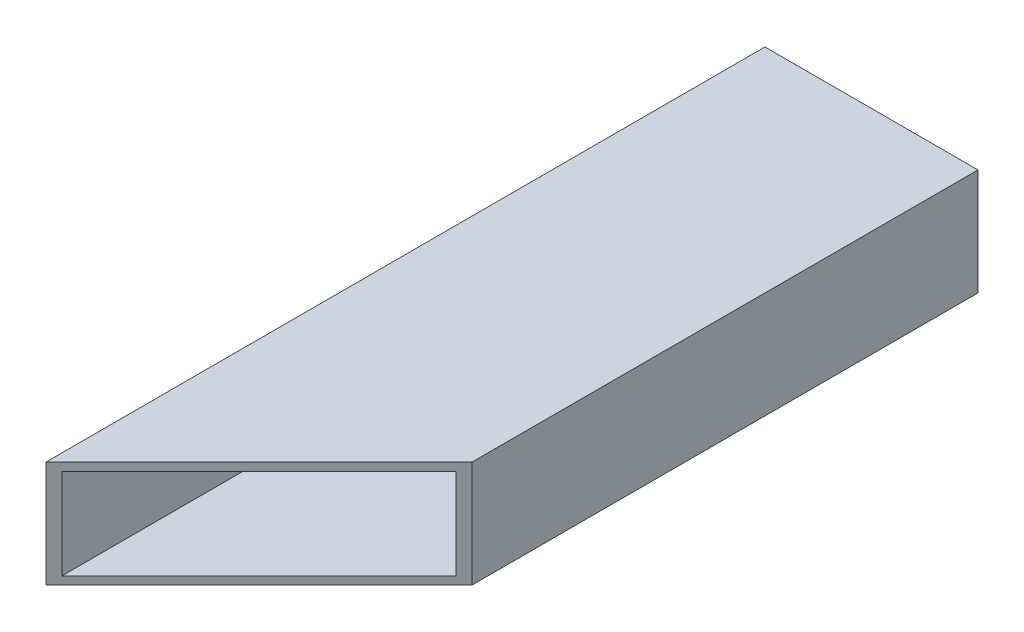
ISO-10303-21;
HEADER;
FILE_DESCRIPTION(('STEP AP214'),'2;1');
FILE_NAME('part.step','',(''),(''),'','','');
FILE_SCHEMA(('AUTOMOTIVE_DESIGN { 1 0 10303 214 1 1 1 1 }'));
ENDSEC;
DATA;
#1=APPLICATION_CONTEXT('core data for automotive mechanical design processes');
#2=APPLICATION_PROTOCOL_DEFINITION('international standard','automotive_design',2000,#1);
#3=PRODUCT_CONTEXT('',#1,'mechanical');
#4=PRODUCT('Part','Part','',(#3));
#5=PRODUCT_RELATED_PRODUCT_CATEGORY('part','',(#4));
#6=PRODUCT_DEFINITION_FORMATION('','',#4);
#7=PRODUCT_DEFINITION_CONTEXT('part definition',#1,'design');
#8=PRODUCT_DEFINITION('design','',#6,#7);
#9=PRODUCT_DEFINITION_SHAPE('','',#8);
#10=(LENGTH_UNIT() NAMED_UNIT(*) SI_UNIT(.MILLI.,.METRE.));
#11=(NAMED_UNIT(*) PLANE_ANGLE_UNIT() SI_UNIT($,.RADIAN.));
#12=(NAMED_UNIT(*) SI_UNIT($,.STERADIAN.) SOLID_ANGLE_UNIT());
#13=UNCERTAINTY_MEASURE_WITH_UNIT(LENGTH_MEASURE(1.E-05),#10,'distance_accuracy_value','');
#14=(GEOMETRIC_REPRESENTATION_CONTEXT(3) GLOBAL_UNCERTAINTY_ASSIGNED_CONTEXT((#13)) GLOBAL_UNIT_ASSIGNED_CONTEXT((#10,
#11,#12)) REPRESENTATION_CONTEXT('',''));
#15=CARTESIAN_POINT('',(0.,0.,0.));
#16=DIRECTION('',(0.,0.,1.));
#17=DIRECTION('',(1.,0.,0.));
#18=AXIS2_PLACEMENT_3D('',#15,#16,#17);
#19=CARTESIAN_POINT('',(0.,40.,0.));
#20=DIRECTION('',(0.,0.,-1.));
#21=DIRECTION('',(-1.,0.,0.));
#22=AXIS2_PLACEMENT_3D('',#19,#20,#21);
#23=PLANE('',#22);
#24=DIRECTION('',(0.,-1.,0.));
#25=VECTOR('',#24,1.);
#26=CARTESIAN_POINT('',(0.,0.,0.));
#27=LINE('',#26,#25);
#28=CARTESIAN_POINT('',(0.,40.,0.));
#29=VERTEX_POINT('',#28);
#30=CARTESIAN_POINT('',(0.,0.,0.));
#31=VERTEX_POINT('',#30);
#32=EDGE_CURVE('E118',#29,#31,#27,.T.);
#33=ORIENTED_EDGE('',*,*,#32,.F.);
#34=DIRECTION('',(-1.,0.,0.));
#35=VECTOR('',#34,1.);
#36=CARTESIAN_POINT('',(0.,40.,0.));
#37=LINE('',#36,#35);
#38=CARTESIAN_POINT('',(80.,40.,0.));
#39=VERTEX_POINT('',#38);
#40=EDGE_CURVE('E138',#39,#29,#37,.T.);
#41=ORIENTED_EDGE('',*,*,#40,.F.);
#42=DIRECTION('',(0.,1.,0.));
#43=VECTOR('',#42,1.);
#44=CARTESIAN_POINT('',(80.,0.,0.));
#45=LINE('',#44,#43);
#46=CARTESIAN_POINT('',(80.,0.,0.));
#47=VERTEX_POINT('',#46);
#48=EDGE_CURVE('E135',#47,#39,#45,.T.);
#49=ORIENTED_EDGE('',*,*,#48,.F.);
#50=DIRECTION('',(1.,0.,0.));
#51=VECTOR('',#50,1.);
#52=CARTESIAN_POINT('',(0.,0.,0.));
#53=LINE('',#52,#51);
#54=EDGE_CURVE('E132',#31,#47,#53,.T.);
#55=ORIENTED_EDGE('',*,*,#54,.F.);
#56=EDGE_LOOP('',(#33,#41,#49,#55));
#57=FACE_BOUND('',#56,.T.);
#58=DIRECTION('',(-1.,0.,0.));
#59=VECTOR('',#58,1.);
#60=CARTESIAN_POINT('',(2.99999999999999,37.,0.));
#61=LINE('',#60,#59);
#62=CARTESIAN_POINT('',(77.,37.,0.));
#63=VERTEX_POINT('',#62);
#64=CARTESIAN_POINT('',(2.99999999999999,37.,0.));
#65=VERTEX_POINT('',#64);
#66=EDGE_CURVE('E121',#63,#65,#61,.T.);
#67=ORIENTED_EDGE('',*,*,#66,.T.);
#68=DIRECTION('',(0.,-1.,0.));
#69=VECTOR('',#68,1.);
#70=CARTESIAN_POINT('',(2.99999999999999,37.,0.));
#71=LINE('',#70,#69);
#72=CARTESIAN_POINT('',(3.,3.,0.));
#73=VERTEX_POINT('',#72);
#74=EDGE_CURVE('E77',#65,#73,#71,.T.);
#75=ORIENTED_EDGE('',*,*,#74,.T.);
#76=DIRECTION('',(1.,0.,0.));
#77=VECTOR('',#76,1.);
#78=CARTESIAN_POINT('',(3.,3.,0.));
#79=LINE('',#78,#77);
#80=CARTESIAN_POINT('',(77.,3.,0.));
#81=VERTEX_POINT('',#80);
#82=EDGE_CURVE('E104',#73,#81,#79,.T.);
#83=ORIENTED_EDGE('',*,*,#82,.T.);
#84=DIRECTION('',(0.,1.,0.));
#85=VECTOR('',#84,1.);
#86=CARTESIAN_POINT('',(77.,37.,0.));
#87=LINE('',#86,#85);
#88=EDGE_CURVE('E113',#81,#63,#87,.T.);
#89=ORIENTED_EDGE('',*,*,#88,.T.);
#90=EDGE_LOOP('',(#67,#75,#83,#89));
#91=FACE_BOUND('',#90,.T.);
#92=ADVANCED_FACE('F32',(#57,#91),#23,.T.);
#93=CARTESIAN_POINT('',(0.,0.,270.));
#94=DIRECTION('',(1.,0.,0.));
#95=DIRECTION('',(0.,1.,0.));
#96=AXIS2_PLACEMENT_3D('',#93,#94,#95);
#97=PLANE('',#96);
#98=ORIENTED_EDGE('',*,*,#32,.T.);
#99=DIRECTION('',(0.,0.,-1.));
#100=VECTOR('',#99,1.);
#101=CARTESIAN_POINT('',(0.,0.,270.));
#102=LINE('',#101,#100);
#103=CARTESIAN_POINT('',(0.,0.,270.));
#104=VERTEX_POINT('',#103);
#105=EDGE_CURVE('E150',#104,#31,#102,.T.);
#106=ORIENTED_EDGE('',*,*,#105,.F.);
#107=DIRECTION('',(0.,-1.,0.));
#108=VECTOR('',#107,1.);
#109=CARTESIAN_POINT('',(0.,0.,270.));
#110=LINE('',#109,#108);
#111=CARTESIAN_POINT('',(0.,40.,270.));
#112=VERTEX_POINT('',#111);
#113=EDGE_CURVE('E140',#112,#104,#110,.T.);
#114=ORIENTED_EDGE('',*,*,#113,.F.);
#115=DIRECTION('',(0.,0.,-1.));
#116=VECTOR('',#115,1.);
#117=CARTESIAN_POINT('',(0.,40.,270.));
#118=LINE('',#117,#116);
#119=EDGE_CURVE('E143',#112,#29,#118,.T.);
#120=ORIENTED_EDGE('',*,*,#119,.T.);
#121=EDGE_LOOP('',(#98,#106,#114,#120));
#122=FACE_BOUND('',#121,.T.);
#123=ADVANCED_FACE('F174',(#122),#97,.F.);
#124=CARTESIAN_POINT('',(0.,0.,270.));
#125=DIRECTION('',(0.,1.,0.));
#126=DIRECTION('',(0.,0.,1.));
#127=AXIS2_PLACEMENT_3D('',#124,#125,#126);
#128=PLANE('',#127);
#129=DIRECTION('',(0.,0.,-1.));
#130=VECTOR('',#129,1.);
#131=CARTESIAN_POINT('',(80.,0.,270.));
#132=LINE('',#131,#130);
#133=CARTESIAN_POINT('',(80.,0.,190.));
#134=VERTEX_POINT('',#133);
#135=EDGE_CURVE('E148',#134,#47,#132,.T.);
#136=ORIENTED_EDGE('',*,*,#135,.F.);
#137=DIRECTION('',(0.707106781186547,0.,-0.707106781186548));
#138=VECTOR('',#137,1.);
#139=CARTESIAN_POINT('',(-2.4980018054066E-13,0.,270.));
#140=LINE('',#139,#138);
#141=EDGE_CURVE('E11',#134,#104,#140,.F.);
#142=ORIENTED_EDGE('',*,*,#141,.T.);
#143=ORIENTED_EDGE('',*,*,#105,.T.);
#144=ORIENTED_EDGE('',*,*,#54,.T.);
#145=EDGE_LOOP('',(#136,#142,#143,#144));
#146=FACE_BOUND('',#145,.T.);
#147=ADVANCED_FACE('F180',(#146),#128,.F.);
#148=CARTESIAN_POINT('',(80.,0.,270.));
#149=DIRECTION('',(-1.,0.,0.));
#150=DIRECTION('',(0.,0.,1.));
#151=AXIS2_PLACEMENT_3D('',#148,#149,#150);
#152=PLANE('',#151);
#153=DIRECTION('',(0.,0.,-1.));
#154=VECTOR('',#153,1.);
#155=CARTESIAN_POINT('',(80.,40.,270.));
#156=LINE('',#155,#154);
#157=CARTESIAN_POINT('',(80.,40.,190.));
#158=VERTEX_POINT('',#157);
#159=EDGE_CURVE('E146',#158,#39,#156,.T.);
#160=ORIENTED_EDGE('',*,*,#159,.F.);
#161=DIRECTION('',(0.,-1.,0.));
#162=VECTOR('',#161,1.);
#163=CARTESIAN_POINT('',(80.,0.,190.));
#164=LINE('',#163,#162);
#165=EDGE_CURVE('E42',#158,#134,#164,.T.);
#166=ORIENTED_EDGE('',*,*,#165,.T.);
#167=ORIENTED_EDGE('',*,*,#135,.T.);
#168=ORIENTED_EDGE('',*,*,#48,.T.);
#169=EDGE_LOOP('',(#160,#166,#167,#168));
#170=FACE_BOUND('',#169,.T.);
#171=ADVANCED_FACE('F188',(#170),#152,.F.);
#172=CARTESIAN_POINT('',(0.,40.,270.));
#173=DIRECTION('',(0.,-1.,0.));
#174=DIRECTION('',(0.,0.,-1.));
#175=AXIS2_PLACEMENT_3D('',#172,#173,#174);
#176=PLANE('',#175);
#177=ORIENTED_EDGE('',*,*,#119,.F.);
#178=DIRECTION('',(-0.707106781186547,0.,0.707106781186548));
#179=VECTOR('',#178,1.);
#180=CARTESIAN_POINT('',(-2.4980018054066E-13,40.,270.));
#181=LINE('',#180,#179);
#182=EDGE_CURVE('E153',#112,#158,#181,.F.);
#183=ORIENTED_EDGE('',*,*,#182,.T.);
#184=ORIENTED_EDGE('',*,*,#159,.T.);
#185=ORIENTED_EDGE('',*,*,#40,.T.);
#186=EDGE_LOOP('',(#177,#183,#184,#185));
#187=FACE_BOUND('',#186,.T.);
#188=ADVANCED_FACE('F185',(#187),#176,.F.);
#189=CARTESIAN_POINT('',(2.99999999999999,37.,270.));
#190=DIRECTION('',(1.,0.,0.));
#191=DIRECTION('',(0.,1.,0.));
#192=AXIS2_PLACEMENT_3D('',#189,#190,#191);
#193=PLANE('',#192);
#194=ORIENTED_EDGE('',*,*,#74,.F.);
#195=DIRECTION('',(0.,0.,-1.));
#196=VECTOR('',#195,1.);
#197=CARTESIAN_POINT('',(2.99999999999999,37.,270.));
#198=LINE('',#197,#196);
#199=CARTESIAN_POINT('',(2.99999999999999,37.,267.));
#200=VERTEX_POINT('',#199);
#201=EDGE_CURVE('E126',#200,#65,#198,.T.);
#202=ORIENTED_EDGE('',*,*,#201,.F.);
#203=DIRECTION('',(0.,1.,0.));
#204=VECTOR('',#203,1.);
#205=CARTESIAN_POINT('',(2.99999999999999,37.,267.));
#206=LINE('',#205,#204);
#207=CARTESIAN_POINT('',(3.,3.,267.));
#208=VERTEX_POINT('',#207);
#209=EDGE_CURVE('E117',#200,#208,#206,.F.);
#210=ORIENTED_EDGE('',*,*,#209,.T.);
#211=DIRECTION('',(0.,0.,-1.));
#212=VECTOR('',#211,1.);
#213=CARTESIAN_POINT('',(3.,3.,270.));
#214=LINE('',#213,#212);
#215=EDGE_CURVE('E106',#208,#73,#214,.T.);
#216=ORIENTED_EDGE('',*,*,#215,.T.);
#217=EDGE_LOOP('',(#194,#202,#210,#216));
#218=FACE_BOUND('',#217,.T.);
#219=ADVANCED_FACE('F115',(#218),#193,.T.);
#220=CARTESIAN_POINT('',(3.,3.,270.));
#221=DIRECTION('',(0.,1.,0.));
#222=DIRECTION('',(0.,0.,1.));
#223=AXIS2_PLACEMENT_3D('',#220,#221,#222);
#224=PLANE('',#223);
#225=ORIENTED_EDGE('',*,*,#82,.F.);
#226=ORIENTED_EDGE('',*,*,#215,.F.);
#227=DIRECTION('',(-0.707106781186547,0.,0.707106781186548));
#228=VECTOR('',#227,1.);
#229=CARTESIAN_POINT('',(1.49999999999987,3.,268.5));
#230=LINE('',#229,#228);
#231=CARTESIAN_POINT('',(77.,3.,193.));
#232=VERTEX_POINT('',#231);
#233=EDGE_CURVE('E157',#208,#232,#230,.F.);
#234=ORIENTED_EDGE('',*,*,#233,.T.);
#235=DIRECTION('',(0.,0.,-1.));
#236=VECTOR('',#235,1.);
#237=CARTESIAN_POINT('',(77.,3.,270.));
#238=LINE('',#237,#236);
#239=EDGE_CURVE('E109',#232,#81,#238,.T.);
#240=ORIENTED_EDGE('',*,*,#239,.T.);
#241=EDGE_LOOP('',(#225,#226,#234,#240));
#242=FACE_BOUND('',#241,.T.);
#243=ADVANCED_FACE('F105',(#242),#224,.T.);
#244=CARTESIAN_POINT('',(77.,37.,270.));
#245=DIRECTION('',(-1.,0.,0.));
#246=DIRECTION('',(0.,0.,1.));
#247=AXIS2_PLACEMENT_3D('',#244,#245,#246);
#248=PLANE('',#247);
#249=ORIENTED_EDGE('',*,*,#88,.F.);
#250=ORIENTED_EDGE('',*,*,#239,.F.);
#251=DIRECTION('',(0.,-1.,0.));
#252=VECTOR('',#251,1.);
#253=CARTESIAN_POINT('',(77.,37.,193.));
#254=LINE('',#253,#252);
#255=CARTESIAN_POINT('',(77.,37.,193.));
#256=VERTEX_POINT('',#255);
#257=EDGE_CURVE('E158',#232,#256,#254,.F.);
#258=ORIENTED_EDGE('',*,*,#257,.T.);
#259=DIRECTION('',(0.,0.,-1.));
#260=VECTOR('',#259,1.);
#261=CARTESIAN_POINT('',(77.,37.,270.));
#262=LINE('',#261,#260);
#263=EDGE_CURVE('E69',#256,#63,#262,.T.);
#264=ORIENTED_EDGE('',*,*,#263,.T.);
#265=EDGE_LOOP('',(#249,#250,#258,#264));
#266=FACE_BOUND('',#265,.T.);
#267=ADVANCED_FACE('F164',(#266),#248,.T.);
#268=CARTESIAN_POINT('',(2.99999999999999,37.,270.));
#269=DIRECTION('',(0.,-1.,0.));
#270=DIRECTION('',(0.,0.,-1.));
#271=AXIS2_PLACEMENT_3D('',#268,#269,#270);
#272=PLANE('',#271);
#273=ORIENTED_EDGE('',*,*,#66,.F.);
#274=ORIENTED_EDGE('',*,*,#263,.F.);
#275=DIRECTION('',(0.707106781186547,0.,-0.707106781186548));
#276=VECTOR('',#275,1.);
#277=CARTESIAN_POINT('',(1.49999999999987,37.,268.5));
#278=LINE('',#277,#276);
#279=EDGE_CURVE('E36',#256,#200,#278,.F.);
#280=ORIENTED_EDGE('',*,*,#279,.T.);
#281=ORIENTED_EDGE('',*,*,#201,.T.);
#282=EDGE_LOOP('',(#273,#274,#280,#281));
#283=FACE_BOUND('',#282,.T.);
#284=ADVANCED_FACE('F162',(#283),#272,.T.);
#285=CARTESIAN_POINT('',(-2.4980018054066E-13,40.,270.));
#286=DIRECTION('',(-0.707106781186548,0.,-0.707106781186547));
#287=DIRECTION('',(-0.707106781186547,0.,0.707106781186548));
#288=AXIS2_PLACEMENT_3D('',#285,#286,#287);
#289=PLANE('',#288);
#290=ORIENTED_EDGE('',*,*,#141,.F.);
#291=ORIENTED_EDGE('',*,*,#165,.F.);
#292=ORIENTED_EDGE('',*,*,#182,.F.);
#293=ORIENTED_EDGE('',*,*,#113,.T.);
#294=EDGE_LOOP('',(#290,#291,#292,#293));
#295=FACE_BOUND('',#294,.T.);
#296=ORIENTED_EDGE('',*,*,#209,.F.);
#297=ORIENTED_EDGE('',*,*,#279,.F.);
#298=ORIENTED_EDGE('',*,*,#257,.F.);
#299=ORIENTED_EDGE('',*,*,#233,.F.);
#300=EDGE_LOOP('',(#296,#297,#298,#299));
#301=FACE_BOUND('',#300,.T.);
#302=ADVANCED_FACE('F34',(#295,#301),#289,.F.);
#303=CLOSED_SHELL('',(#92,#123,#147,#171,#188,#219,#243,#267,#284,#302));
#304=MANIFOLD_SOLID_BREP('B2',#303);
#305=ADVANCED_BREP_SHAPE_REPRESENTATION('',(#18,#304),#14);
#306=SHAPE_DEFINITION_REPRESENTATION(#9,#305);
ENDSEC;
END-ISO-10303-21;
